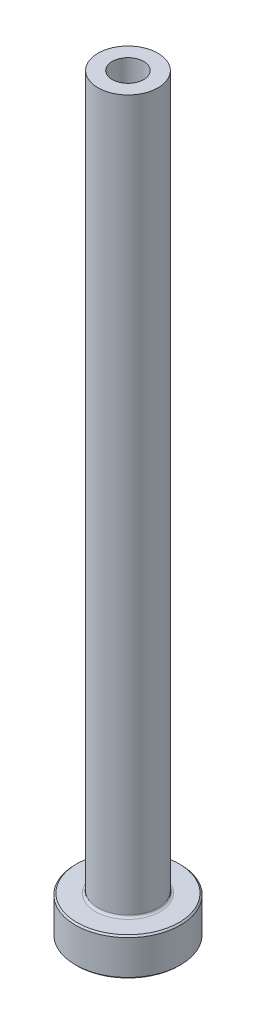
ISO-10303-21;
HEADER;
FILE_DESCRIPTION(('STEP AP214'),'2;1');
FILE_NAME('part.step','',(''),(''),'','','');
FILE_SCHEMA(('AUTOMOTIVE_DESIGN { 1 0 10303 214 1 1 1 1 }'));
ENDSEC;
DATA;
#1=APPLICATION_CONTEXT('core data for automotive mechanical design processes');
#2=APPLICATION_PROTOCOL_DEFINITION('international standard','automotive_design',2000,#1);
#3=PRODUCT_CONTEXT('',#1,'mechanical');
#4=PRODUCT('Part','Part','',(#3));
#5=PRODUCT_RELATED_PRODUCT_CATEGORY('part','',(#4));
#6=PRODUCT_DEFINITION_FORMATION('','',#4);
#7=PRODUCT_DEFINITION_CONTEXT('part definition',#1,'design');
#8=PRODUCT_DEFINITION('design','',#6,#7);
#9=PRODUCT_DEFINITION_SHAPE('','',#8);
#10=(LENGTH_UNIT() NAMED_UNIT(*) SI_UNIT(.MILLI.,.METRE.));
#11=(NAMED_UNIT(*) PLANE_ANGLE_UNIT() SI_UNIT($,.RADIAN.));
#12=(NAMED_UNIT(*) SI_UNIT($,.STERADIAN.) SOLID_ANGLE_UNIT());
#13=UNCERTAINTY_MEASURE_WITH_UNIT(LENGTH_MEASURE(1.E-05),#10,'distance_accuracy_value','');
#14=(GEOMETRIC_REPRESENTATION_CONTEXT(3) GLOBAL_UNCERTAINTY_ASSIGNED_CONTEXT((#13)) GLOBAL_UNIT_ASSIGNED_CONTEXT((#10,
#11,#12)) REPRESENTATION_CONTEXT('',''));
#15=CARTESIAN_POINT('',(0.,0.,0.));
#16=DIRECTION('',(0.,0.,1.));
#17=DIRECTION('',(1.,0.,0.));
#18=AXIS2_PLACEMENT_3D('',#15,#16,#17);
#19=CARTESIAN_POINT('',(0.,92.1876809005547,0.));
#20=DIRECTION('',(0.,1.,0.));
#21=DIRECTION('',(0.,0.,1.));
#22=AXIS2_PLACEMENT_3D('',#19,#20,#21);
#23=CYLINDRICAL_SURFACE('',#22,2.09999999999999);
#24=CARTESIAN_POINT('',(0.,100.,0.));
#25=DIRECTION('',(0.,1.,0.));
#26=DIRECTION('',(0.,0.,1.));
#27=AXIS2_PLACEMENT_3D('',#24,#25,#26);
#28=CIRCLE('',#27,2.09999999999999);
#29=CARTESIAN_POINT('',(0.,100.,2.09999999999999));
#30=VERTEX_POINT('',#29);
#31=EDGE_CURVE('E62',#30,#30,#28,.T.);
#32=ORIENTED_EDGE('',*,*,#31,.T.);
#33=EDGE_LOOP('',(#32));
#34=FACE_BOUND('',#33,.T.);
#35=CARTESIAN_POINT('',(0.,55.,0.));
#36=DIRECTION('',(0.,1.,0.));
#37=DIRECTION('',(0.,0.,1.));
#38=AXIS2_PLACEMENT_3D('',#35,#36,#37);
#39=CIRCLE('',#38,2.09999999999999);
#40=CARTESIAN_POINT('',(0.,55.,2.09999999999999));
#41=VERTEX_POINT('',#40);
#42=EDGE_CURVE('E71',#41,#41,#39,.T.);
#43=ORIENTED_EDGE('',*,*,#42,.F.);
#44=EDGE_LOOP('',(#43));
#45=FACE_BOUND('',#44,.T.);
#46=ADVANCED_FACE('F30',(#34,#45),#23,.F.);
#47=CARTESIAN_POINT('',(-2.09999999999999,100.,0.));
#48=DIRECTION('',(0.,1.,0.));
#49=DIRECTION('',(0.,0.,1.));
#50=AXIS2_PLACEMENT_3D('',#47,#48,#49);
#51=PLANE('',#50);
#52=CARTESIAN_POINT('',(0.,100.,0.));
#53=DIRECTION('',(0.,1.,0.));
#54=DIRECTION('',(0.,0.,1.));
#55=AXIS2_PLACEMENT_3D('',#52,#53,#54);
#56=CIRCLE('',#55,4.);
#57=CARTESIAN_POINT('',(0.,100.,4.));
#58=VERTEX_POINT('',#57);
#59=EDGE_CURVE('E65',#58,#58,#56,.T.);
#60=ORIENTED_EDGE('',*,*,#59,.T.);
#61=EDGE_LOOP('',(#60));
#62=FACE_BOUND('',#61,.T.);
#63=ORIENTED_EDGE('',*,*,#31,.F.);
#64=EDGE_LOOP('',(#63));
#65=FACE_BOUND('',#64,.T.);
#66=ADVANCED_FACE('F79',(#62,#65),#51,.T.);
#67=CARTESIAN_POINT('',(0.,92.1876809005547,0.));
#68=DIRECTION('',(0.,1.,0.));
#69=DIRECTION('',(0.,0.,1.));
#70=AXIS2_PLACEMENT_3D('',#67,#68,#69);
#71=CYLINDRICAL_SURFACE('',#70,3.99999999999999);
#72=CARTESIAN_POINT('',(0.,5.3,0.));
#73=DIRECTION('',(0.,1.,0.));
#74=DIRECTION('',(0.,0.,1.));
#75=AXIS2_PLACEMENT_3D('',#72,#73,#74);
#76=CIRCLE('',#75,3.99999999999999);
#77=CARTESIAN_POINT('',(0.,5.3,3.99999999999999));
#78=VERTEX_POINT('',#77);
#79=EDGE_CURVE('E59',#78,#78,#76,.T.);
#80=ORIENTED_EDGE('',*,*,#79,.T.);
#81=EDGE_LOOP('',(#80));
#82=FACE_BOUND('',#81,.T.);
#83=ORIENTED_EDGE('',*,*,#59,.F.);
#84=EDGE_LOOP('',(#83));
#85=FACE_BOUND('',#84,.T.);
#86=ADVANCED_FACE('F85',(#82,#85),#71,.T.);
#87=CARTESIAN_POINT('',(-3.99999999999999,5.,0.));
#88=DIRECTION('',(0.,1.,0.));
#89=DIRECTION('',(0.,0.,1.));
#90=AXIS2_PLACEMENT_3D('',#87,#88,#89);
#91=PLANE('',#90);
#92=CARTESIAN_POINT('',(0.,5.,0.));
#93=DIRECTION('',(0.,1.,0.));
#94=DIRECTION('',(0.,0.,1.));
#95=AXIS2_PLACEMENT_3D('',#92,#93,#94);
#96=CIRCLE('',#95,6.79999999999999);
#97=CARTESIAN_POINT('',(0.,5.,6.79999999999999));
#98=VERTEX_POINT('',#97);
#99=EDGE_CURVE('E53',#98,#98,#96,.T.);
#100=ORIENTED_EDGE('',*,*,#99,.T.);
#101=EDGE_LOOP('',(#100));
#102=FACE_BOUND('',#101,.T.);
#103=CARTESIAN_POINT('',(0.,5.,0.));
#104=DIRECTION('',(0.,1.,0.));
#105=DIRECTION('',(0.,0.,1.));
#106=AXIS2_PLACEMENT_3D('',#103,#104,#105);
#107=CIRCLE('',#106,4.29999999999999);
#108=CARTESIAN_POINT('',(0.,5.,4.29999999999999));
#109=VERTEX_POINT('',#108);
#110=EDGE_CURVE('E56',#109,#109,#107,.F.);
#111=ORIENTED_EDGE('',*,*,#110,.T.);
#112=EDGE_LOOP('',(#111));
#113=FACE_BOUND('',#112,.T.);
#114=ADVANCED_FACE('F111',(#102,#113),#91,.T.);
#115=CARTESIAN_POINT('',(0.,92.1876809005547,0.));
#116=DIRECTION('',(0.,1.,0.));
#117=DIRECTION('',(0.,0.,1.));
#118=AXIS2_PLACEMENT_3D('',#115,#116,#117);
#119=CYLINDRICAL_SURFACE('',#118,6.99999999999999);
#120=CARTESIAN_POINT('',(0.,4.8,0.));
#121=DIRECTION('',(0.,1.,0.));
#122=DIRECTION('',(0.,0.,1.));
#123=AXIS2_PLACEMENT_3D('',#120,#121,#122);
#124=CIRCLE('',#123,6.99999999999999);
#125=CARTESIAN_POINT('',(0.,4.8,6.99999999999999));
#126=VERTEX_POINT('',#125);
#127=EDGE_CURVE('E45',#126,#126,#124,.F.);
#128=ORIENTED_EDGE('',*,*,#127,.T.);
#129=EDGE_LOOP('',(#128));
#130=FACE_BOUND('',#129,.T.);
#131=CARTESIAN_POINT('',(0.,0.199999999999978,0.));
#132=DIRECTION('',(0.,-1.,0.));
#133=DIRECTION('',(0.,0.,-1.));
#134=AXIS2_PLACEMENT_3D('',#131,#132,#133);
#135=CIRCLE('',#134,6.99999999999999);
#136=CARTESIAN_POINT('',(0.,0.199999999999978,6.99999999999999));
#137=VERTEX_POINT('',#136);
#138=EDGE_CURVE('E50',#137,#137,#135,.F.);
#139=ORIENTED_EDGE('',*,*,#138,.T.);
#140=EDGE_LOOP('',(#139));
#141=FACE_BOUND('',#140,.T.);
#142=ADVANCED_FACE('F108',(#130,#141),#119,.T.);
#143=CARTESIAN_POINT('',(-6.99999999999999,0.,0.));
#144=DIRECTION('',(0.,-1.,0.));
#145=DIRECTION('',(0.,0.,-1.));
#146=AXIS2_PLACEMENT_3D('',#143,#144,#145);
#147=PLANE('',#146);
#148=CARTESIAN_POINT('',(0.,0.,0.));
#149=DIRECTION('',(0.,-1.,0.));
#150=DIRECTION('',(0.,0.,-1.));
#151=AXIS2_PLACEMENT_3D('',#148,#149,#150);
#152=CIRCLE('',#151,2.84999999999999);
#153=CARTESIAN_POINT('',(0.,0.,-2.84999999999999));
#154=VERTEX_POINT('',#153);
#155=EDGE_CURVE('E37',#154,#154,#152,.F.);
#156=ORIENTED_EDGE('',*,*,#155,.T.);
#157=EDGE_LOOP('',(#156));
#158=FACE_BOUND('',#157,.T.);
#159=CARTESIAN_POINT('',(0.,0.,0.));
#160=DIRECTION('',(0.,-1.,0.));
#161=DIRECTION('',(0.,0.,-1.));
#162=AXIS2_PLACEMENT_3D('',#159,#160,#161);
#163=CIRCLE('',#162,6.80000000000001);
#164=CARTESIAN_POINT('',(0.,0.,6.80000000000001));
#165=VERTEX_POINT('',#164);
#166=EDGE_CURVE('E41',#165,#165,#163,.T.);
#167=ORIENTED_EDGE('',*,*,#166,.T.);
#168=EDGE_LOOP('',(#167));
#169=FACE_BOUND('',#168,.T.);
#170=ADVANCED_FACE('F110',(#158,#169),#147,.T.);
#171=CARTESIAN_POINT('',(0.,92.1876809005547,0.));
#172=DIRECTION('',(0.,1.,0.));
#173=DIRECTION('',(0.,0.,1.));
#174=AXIS2_PLACEMENT_3D('',#171,#172,#173);
#175=CYLINDRICAL_SURFACE('',#174,2.34999999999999);
#176=CARTESIAN_POINT('',(0.,0.5,0.));
#177=DIRECTION('',(0.,-1.,0.));
#178=DIRECTION('',(0.,0.,-1.));
#179=AXIS2_PLACEMENT_3D('',#176,#177,#178);
#180=CIRCLE('',#179,2.34999999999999);
#181=CARTESIAN_POINT('',(0.,0.5,-2.34999999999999));
#182=VERTEX_POINT('',#181);
#183=EDGE_CURVE('E10',#182,#182,#180,.T.);
#184=ORIENTED_EDGE('',*,*,#183,.T.);
#185=EDGE_LOOP('',(#184));
#186=FACE_BOUND('',#185,.T.);
#187=CARTESIAN_POINT('',(0.,43.,0.));
#188=DIRECTION('',(0.,1.,0.));
#189=DIRECTION('',(0.,0.,1.));
#190=AXIS2_PLACEMENT_3D('',#187,#188,#189);
#191=CIRCLE('',#190,2.35);
#192=CARTESIAN_POINT('',(0.,43.,2.35));
#193=VERTEX_POINT('',#192);
#194=EDGE_CURVE('E68',#193,#193,#191,.T.);
#195=ORIENTED_EDGE('',*,*,#194,.T.);
#196=EDGE_LOOP('',(#195));
#197=FACE_BOUND('',#196,.T.);
#198=ADVANCED_FACE('F118',(#186,#197),#175,.F.);
#199=CARTESIAN_POINT('',(0.,43.,0.));
#200=DIRECTION('',(0.,-1.,0.));
#201=DIRECTION('',(0.,0.,-1.));
#202=AXIS2_PLACEMENT_3D('',#199,#200,#201);
#203=CONICAL_SURFACE('',#202,2.35,0.0208303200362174);
#204=ORIENTED_EDGE('',*,*,#42,.T.);
#205=EDGE_LOOP('',(#204));
#206=FACE_BOUND('',#205,.T.);
#207=ORIENTED_EDGE('',*,*,#194,.F.);
#208=EDGE_LOOP('',(#207));
#209=FACE_BOUND('',#208,.T.);
#210=ADVANCED_FACE('F75',(#206,#209),#203,.F.);
#211=CARTESIAN_POINT('',(0.,5.3,0.));
#212=DIRECTION('',(0.,1.,0.));
#213=DIRECTION('',(0.,0.,1.));
#214=AXIS2_PLACEMENT_3D('',#211,#212,#213);
#215=TOROIDAL_SURFACE('',#214,4.29999999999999,0.3);
#216=ORIENTED_EDGE('',*,*,#110,.F.);
#217=EDGE_LOOP('',(#216));
#218=FACE_BOUND('',#217,.T.);
#219=ORIENTED_EDGE('',*,*,#79,.F.);
#220=EDGE_LOOP('',(#219));
#221=FACE_BOUND('',#220,.T.);
#222=ADVANCED_FACE('F90',(#218,#221),#215,.F.);
#223=CARTESIAN_POINT('',(0.,5.,0.));
#224=DIRECTION('',(0.,-1.,0.));
#225=DIRECTION('',(0.,0.,-1.));
#226=AXIS2_PLACEMENT_3D('',#223,#224,#225);
#227=CONICAL_SURFACE('',#226,6.79999999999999,0.78539816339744);
#228=ORIENTED_EDGE('',*,*,#127,.F.);
#229=EDGE_LOOP('',(#228));
#230=FACE_BOUND('',#229,.T.);
#231=ORIENTED_EDGE('',*,*,#99,.F.);
#232=EDGE_LOOP('',(#231));
#233=FACE_BOUND('',#232,.T.);
#234=ADVANCED_FACE('F93',(#230,#233),#227,.T.);
#235=CARTESIAN_POINT('',(0.,0.199999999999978,0.));
#236=DIRECTION('',(0.,1.,0.));
#237=DIRECTION('',(0.,0.,1.));
#238=AXIS2_PLACEMENT_3D('',#235,#236,#237);
#239=CONICAL_SURFACE('',#238,6.99999999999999,0.78539816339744);
#240=CARTESIAN_POINT('',(0.,0.,6.80000000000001));
#241=CARTESIAN_POINT('',(0.,0.00208333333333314,6.80208333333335));
#242=CARTESIAN_POINT('',(0.,0.00416666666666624,6.80416666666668));
#243=CARTESIAN_POINT('',(0.,0.00833333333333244,6.80833333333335));
#244=CARTESIAN_POINT('',(0.,0.0104166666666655,6.81041666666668));
#245=CARTESIAN_POINT('',(0.,0.0145833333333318,6.81458333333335));
#246=CARTESIAN_POINT('',(0.,0.0166666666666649,6.81666666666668));
#247=CARTESIAN_POINT('',(0.,0.020833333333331,6.82083333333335));
#248=CARTESIAN_POINT('',(0.,0.0229166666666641,6.82291666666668));
#249=CARTESIAN_POINT('',(0.,0.0270833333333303,6.82708333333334));
#250=CARTESIAN_POINT('',(0.,0.0291666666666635,6.82916666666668));
#251=CARTESIAN_POINT('',(0.,0.0333333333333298,6.83333333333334));
#252=CARTESIAN_POINT('',(0.,0.0354166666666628,6.83541666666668));
#253=CARTESIAN_POINT('',(0.,0.039583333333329,6.83958333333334));
#254=CARTESIAN_POINT('',(0.,0.0416666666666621,6.84166666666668));
#255=CARTESIAN_POINT('',(0.,0.0458333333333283,6.84583333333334));
#256=CARTESIAN_POINT('',(0.,0.0479166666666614,6.84791666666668));
#257=CARTESIAN_POINT('',(0.,0.0520833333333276,6.85208333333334));
#258=CARTESIAN_POINT('',(0.,0.0541666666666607,6.85416666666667));
#259=CARTESIAN_POINT('',(0.,0.0583333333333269,6.85833333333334));
#260=CARTESIAN_POINT('',(0.,0.0604166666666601,6.86041666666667));
#261=CARTESIAN_POINT('',(0.,0.0645833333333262,6.86458333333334));
#262=CARTESIAN_POINT('',(0.,0.0666666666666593,6.86666666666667));
#263=CARTESIAN_POINT('',(0.,0.0708333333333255,6.87083333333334));
#264=CARTESIAN_POINT('',(0.,0.0729166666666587,6.87291666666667));
#265=CARTESIAN_POINT('',(0.,0.077083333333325,6.87708333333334));
#266=CARTESIAN_POINT('',(0.,0.079166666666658,6.87916666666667));
#267=CARTESIAN_POINT('',(0.,0.0833333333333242,6.88333333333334));
#268=CARTESIAN_POINT('',(0.,0.0854166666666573,6.88541666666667));
#269=CARTESIAN_POINT('',(0.,0.0895833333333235,6.88958333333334));
#270=CARTESIAN_POINT('',(0.,0.0916666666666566,6.89166666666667));
#271=CARTESIAN_POINT('',(0.,0.0958333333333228,6.89583333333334));
#272=CARTESIAN_POINT('',(0.,0.0979166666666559,6.89791666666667));
#273=CARTESIAN_POINT('',(0.,0.102083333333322,6.90208333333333));
#274=CARTESIAN_POINT('',(0.,0.104166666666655,6.90416666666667));
#275=CARTESIAN_POINT('',(0.,0.108333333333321,6.90833333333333));
#276=CARTESIAN_POINT('',(0.,0.110416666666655,6.91041666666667));
#277=CARTESIAN_POINT('',(0.,0.114583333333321,6.91458333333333));
#278=CARTESIAN_POINT('',(0.,0.116666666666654,6.91666666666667));
#279=CARTESIAN_POINT('',(0.,0.12083333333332,6.92083333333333));
#280=CARTESIAN_POINT('',(0.,0.122916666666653,6.92291666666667));
#281=CARTESIAN_POINT('',(0.,0.127083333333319,6.92708333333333));
#282=CARTESIAN_POINT('',(0.,0.129166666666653,6.92916666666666));
#283=CARTESIAN_POINT('',(0.,0.133333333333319,6.93333333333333));
#284=CARTESIAN_POINT('',(0.,0.135416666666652,6.93541666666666));
#285=CARTESIAN_POINT('',(0.,0.139583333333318,6.93958333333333));
#286=CARTESIAN_POINT('',(0.,0.141666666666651,6.94166666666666));
#287=CARTESIAN_POINT('',(0.,0.145833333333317,6.94583333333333));
#288=CARTESIAN_POINT('',(0.,0.14791666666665,6.94791666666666));
#289=CARTESIAN_POINT('',(0.,0.152083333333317,6.95208333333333));
#290=CARTESIAN_POINT('',(0.,0.15416666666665,6.95416666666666));
#291=CARTESIAN_POINT('',(0.,0.158333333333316,6.95833333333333));
#292=CARTESIAN_POINT('',(0.,0.160416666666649,6.96041666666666));
#293=CARTESIAN_POINT('',(0.,0.164583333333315,6.96458333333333));
#294=CARTESIAN_POINT('',(0.,0.166666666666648,6.96666666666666));
#295=CARTESIAN_POINT('',(0.,0.170833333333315,6.97083333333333));
#296=CARTESIAN_POINT('',(0.,0.172916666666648,6.97291666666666));
#297=CARTESIAN_POINT('',(0.,0.177083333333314,6.97708333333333));
#298=CARTESIAN_POINT('',(0.,0.179166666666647,6.97916666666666));
#299=CARTESIAN_POINT('',(0.,0.183333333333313,6.98333333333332));
#300=CARTESIAN_POINT('',(0.,0.185416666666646,6.98541666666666));
#301=CARTESIAN_POINT('',(0.,0.189583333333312,6.98958333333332));
#302=CARTESIAN_POINT('',(0.,0.191666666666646,6.99166666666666));
#303=CARTESIAN_POINT('',(0.,0.195833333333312,6.99583333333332));
#304=CARTESIAN_POINT('',(0.,0.197916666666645,6.99791666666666));
#305=CARTESIAN_POINT('',(0.,0.199999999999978,6.99999999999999));
#306=B_SPLINE_CURVE_WITH_KNOTS('',3,(#240,#241,#242,#243,#244,#245,#246,#247,#248,#249,#250,
#251,#252,#253,#254,#255,#256,#257,#258,#259,#260,#261,#262,#263,#264,#265,#266,#267,#268,#269,
#270,#271,#272,#273,#274,#275,#276,#277,#278,#279,#280,#281,#282,#283,#284,#285,#286,#287,#288,
#289,#290,#291,#292,#293,#294,#295,#296,#297,#298,#299,#300,#301,#302,#303,#304,#305),
.UNSPECIFIED.,.F.,.F.,(4,2,2,2,2,2,2,2,2,2,2,2,2,2,2,2,2,2,2,2,2,2,2,2,2,2,2,2,2,2,2,2,4),(0.,
0.00883883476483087,0.0176776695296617,0.0265165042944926,0.0353553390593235,0.0441941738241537,
0.0530330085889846,0.0618718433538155,0.0707106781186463,0.0795495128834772,0.0883883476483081,
0.0972271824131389,0.106066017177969,0.1149048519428,0.123743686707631,0.132582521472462,
0.141421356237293,0.150260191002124,0.159099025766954,0.167937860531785,0.176776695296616,
0.185615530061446,0.194454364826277,0.203293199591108,0.212132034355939,0.22097086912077,
0.229809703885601,0.238648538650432,0.247487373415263,0.256326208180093,0.265165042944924,
0.274003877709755,0.282842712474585),.UNSPECIFIED.);
#307=EDGE_CURVE('BSEAM96',#165,#137,#306,.T.);
#308=ORIENTED_EDGE('',*,*,#166,.F.);
#309=ORIENTED_EDGE('',*,*,#138,.F.);
#310=ORIENTED_EDGE('',*,*,#307,.T.);
#311=ORIENTED_EDGE('',*,*,#307,.F.);
#312=EDGE_LOOP('',(#308,#310,#309,#311));
#313=FACE_BOUND('',#312,.T.);
#314=ADVANCED_FACE('F96',(#313),#239,.T.);
#315=CARTESIAN_POINT('',(0.,0.,0.));
#316=DIRECTION('',(0.,-1.,0.));
#317=DIRECTION('',(0.,0.,-1.));
#318=AXIS2_PLACEMENT_3D('',#315,#316,#317);
#319=CONICAL_SURFACE('',#318,2.84999999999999,0.785398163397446);
#320=ORIENTED_EDGE('',*,*,#183,.F.);
#321=EDGE_LOOP('',(#320));
#322=FACE_BOUND('',#321,.T.);
#323=ORIENTED_EDGE('',*,*,#155,.F.);
#324=EDGE_LOOP('',(#323));
#325=FACE_BOUND('',#324,.T.);
#326=ADVANCED_FACE('F32',(#322,#325),#319,.F.);
#327=CLOSED_SHELL('',(#46,#66,#86,#114,#142,#170,#198,#210,#222,#234,#314,#326));
#328=MANIFOLD_SOLID_BREP('B2',#327);
#329=ADVANCED_BREP_SHAPE_REPRESENTATION('',(#18,#328),#14);
#330=SHAPE_DEFINITION_REPRESENTATION(#9,#329);
ENDSEC;
END-ISO-10303-21;
